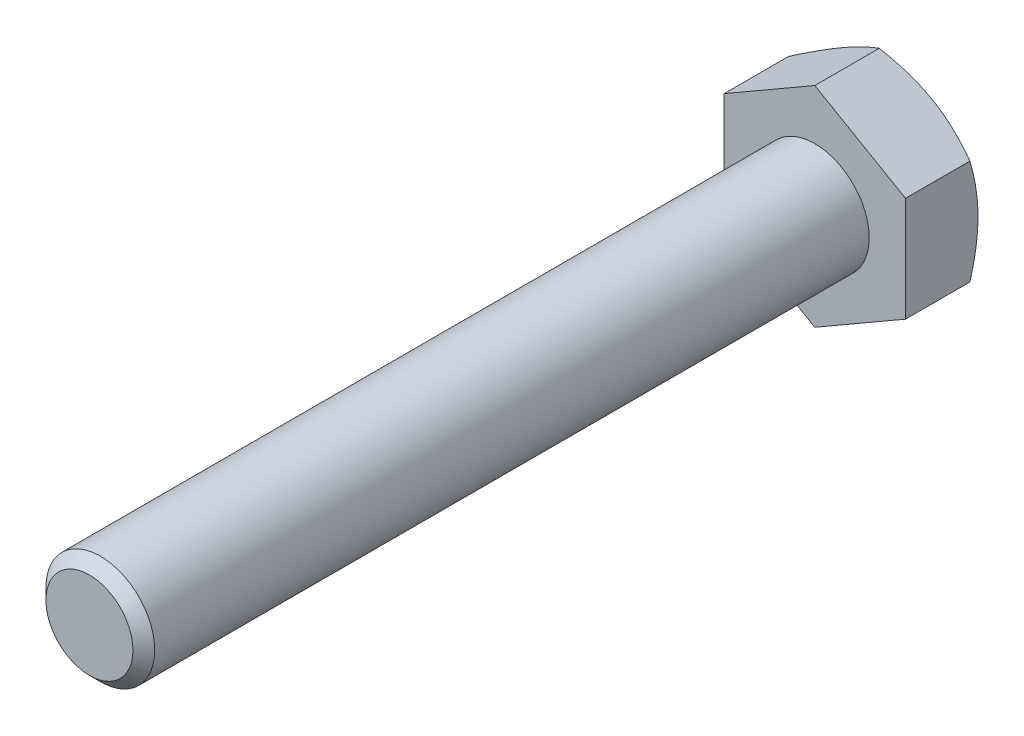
ISO-10303-21;
HEADER;
FILE_DESCRIPTION(('STEP AP214'),'2;1');
FILE_NAME('part.step','',(''),(''),'','','');
FILE_SCHEMA(('AUTOMOTIVE_DESIGN { 1 0 10303 214 1 1 1 1 }'));
ENDSEC;
DATA;
#1=APPLICATION_CONTEXT('core data for automotive mechanical design processes');
#2=APPLICATION_PROTOCOL_DEFINITION('international standard','automotive_design',2000,#1);
#3=PRODUCT_CONTEXT('',#1,'mechanical');
#4=PRODUCT('Part','Part','',(#3));
#5=PRODUCT_RELATED_PRODUCT_CATEGORY('part','',(#4));
#6=PRODUCT_DEFINITION_FORMATION('','',#4);
#7=PRODUCT_DEFINITION_CONTEXT('part definition',#1,'design');
#8=PRODUCT_DEFINITION('design','',#6,#7);
#9=PRODUCT_DEFINITION_SHAPE('','',#8);
#10=(LENGTH_UNIT() NAMED_UNIT(*) SI_UNIT(.MILLI.,.METRE.));
#11=(NAMED_UNIT(*) PLANE_ANGLE_UNIT() SI_UNIT($,.RADIAN.));
#12=(NAMED_UNIT(*) SI_UNIT($,.STERADIAN.) SOLID_ANGLE_UNIT());
#13=UNCERTAINTY_MEASURE_WITH_UNIT(LENGTH_MEASURE(1.E-05),#10,'distance_accuracy_value','');
#14=(GEOMETRIC_REPRESENTATION_CONTEXT(3) GLOBAL_UNCERTAINTY_ASSIGNED_CONTEXT((#13)) GLOBAL_UNIT_ASSIGNED_CONTEXT((#10,
#11,#12)) REPRESENTATION_CONTEXT('',''));
#15=CARTESIAN_POINT('',(0.,0.,0.));
#16=DIRECTION('',(0.,0.,1.));
#17=DIRECTION('',(1.,0.,0.));
#18=AXIS2_PLACEMENT_3D('',#15,#16,#17);
#19=CARTESIAN_POINT('',(0.,0.,40.));
#20=DIRECTION('',(0.,0.,1.));
#21=DIRECTION('',(1.,0.,0.));
#22=AXIS2_PLACEMENT_3D('',#19,#20,#21);
#23=PLANE('',#22);
#24=CARTESIAN_POINT('',(0.,0.,40.));
#25=DIRECTION('',(0.,0.,1.));
#26=DIRECTION('',(1.,0.,0.));
#27=AXIS2_PLACEMENT_3D('',#24,#25,#26);
#28=CIRCLE('',#27,2.4);
#29=CARTESIAN_POINT('',(2.40000000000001,0.,40.));
#30=VERTEX_POINT('',#29);
#31=EDGE_CURVE('E202',#30,#30,#28,.T.);
#32=ORIENTED_EDGE('',*,*,#31,.T.);
#33=EDGE_LOOP('',(#32));
#34=FACE_BOUND('',#33,.T.);
#35=ADVANCED_FACE('F28',(#34),#23,.T.);
#36=CARTESIAN_POINT('',(0.,0.,0.));
#37=DIRECTION('',(0.,0.,1.));
#38=DIRECTION('',(1.,0.,0.));
#39=AXIS2_PLACEMENT_3D('',#36,#37,#38);
#40=CYLINDRICAL_SURFACE('',#39,3.);
#41=CARTESIAN_POINT('',(0.,0.,39.4));
#42=DIRECTION('',(0.,0.,1.));
#43=DIRECTION('',(1.,0.,0.));
#44=AXIS2_PLACEMENT_3D('',#41,#42,#43);
#45=CIRCLE('',#44,3.);
#46=CARTESIAN_POINT('',(3.,0.,39.4));
#47=VERTEX_POINT('',#46);
#48=EDGE_CURVE('E204',#47,#47,#45,.F.);
#49=ORIENTED_EDGE('',*,*,#48,.T.);
#50=EDGE_LOOP('',(#49));
#51=FACE_BOUND('',#50,.T.);
#52=CARTESIAN_POINT('',(0.,0.,0.));
#53=DIRECTION('',(0.,0.,1.));
#54=DIRECTION('',(1.,0.,0.));
#55=AXIS2_PLACEMENT_3D('',#52,#53,#54);
#56=CIRCLE('',#55,3.);
#57=CARTESIAN_POINT('',(3.,0.,0.));
#58=VERTEX_POINT('',#57);
#59=EDGE_CURVE('E205',#58,#58,#56,.F.);
#60=ORIENTED_EDGE('',*,*,#59,.F.);
#61=EDGE_LOOP('',(#60));
#62=FACE_BOUND('',#61,.T.);
#63=ADVANCED_FACE('F193',(#51,#62),#40,.T.);
#64=CARTESIAN_POINT('',(0.,0.,40.));
#65=DIRECTION('',(0.,0.,-1.));
#66=DIRECTION('',(-1.,0.,0.));
#67=AXIS2_PLACEMENT_3D('',#64,#65,#66);
#68=CONICAL_SURFACE('',#67,2.4,0.785398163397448);
#69=ORIENTED_EDGE('',*,*,#48,.F.);
#70=EDGE_LOOP('',(#69));
#71=FACE_BOUND('',#70,.T.);
#72=ORIENTED_EDGE('',*,*,#31,.F.);
#73=EDGE_LOOP('',(#72));
#74=FACE_BOUND('',#73,.T.);
#75=ADVANCED_FACE('F198',(#71,#74),#68,.T.);
#76=CARTESIAN_POINT('',(0.,5.77350269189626,-4.));
#77=DIRECTION('',(0.499999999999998,0.86602540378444,0.));
#78=DIRECTION('',(-0.86602540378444,0.499999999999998,0.));
#79=AXIS2_PLACEMENT_3D('',#76,#77,#78);
#80=PLANE('',#79);
#81=CARTESIAN_POINT('',(-0.000200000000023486,5.7736181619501,-3.55335134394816));
#82=CARTESIAN_POINT('',(0.219534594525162,5.64675433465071,-3.62661343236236));
#83=CARTESIAN_POINT('',(0.441148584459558,5.5188054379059,-3.6932486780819));
#84=CARTESIAN_POINT('',(0.888213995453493,5.26069210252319,-3.80956100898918));
#85=CARTESIAN_POINT('',(1.11367335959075,5.13052307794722,-3.85919695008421));
#86=CARTESIAN_POINT('',(1.56183230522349,4.87177839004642,-3.9364489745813));
#87=CARTESIAN_POINT('',(1.78446209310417,4.74324302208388,-3.96457962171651));
#88=CARTESIAN_POINT('',(2.11918990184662,4.54998783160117,-3.98980507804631));
#89=CARTESIAN_POINT('',(2.23084219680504,4.48552534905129,-3.99538654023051));
#90=CARTESIAN_POINT('',(2.45424997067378,4.35654081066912,-4.00079778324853));
#91=CARTESIAN_POINT('',(2.5660054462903,4.29201875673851,-4.00062774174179));
#92=CARTESIAN_POINT('',(2.87218423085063,4.11524635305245,-3.99224636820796));
#93=CARTESIAN_POINT('',(3.0665060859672,4.00305457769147,-3.97817022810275));
#94=CARTESIAN_POINT('',(3.45386010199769,3.77941563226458,-3.93353474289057));
#95=CARTESIAN_POINT('',(3.64689090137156,3.66796924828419,-3.90296013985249));
#96=CARTESIAN_POINT('',(4.03502534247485,3.44387972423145,-3.82653150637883));
#97=CARTESIAN_POINT('',(4.23007999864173,3.33126486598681,-3.78035362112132));
#98=CARTESIAN_POINT('',(4.61728034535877,3.10771464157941,-3.67554820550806));
#99=CARTESIAN_POINT('',(4.80943099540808,2.99677641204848,-3.61694529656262));
#100=CARTESIAN_POINT('',(5.0002,2.8866358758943,-3.55335134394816));
#101=B_SPLINE_CURVE_WITH_KNOTS('',3,(#81,#82,#83,#84,#85,#86,#87,#88,#89,#90,#91,#92,#93,#94,
#95,#96,#97,#98,#99,#100),.UNSPECIFIED.,.F.,.F.,(4,2,2,2,2,2,2,2,2,4),(0.,0.792555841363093,
1.58701660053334,2.36181537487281,2.74884076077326,3.13585419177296,3.8096236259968,
4.4840172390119,5.1733688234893,5.86136694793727),.UNSPECIFIED.);
#102=CARTESIAN_POINT('',(0.,5.77350269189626,-3.55341801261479));
#103=VERTEX_POINT('',#102);
#104=CARTESIAN_POINT('',(2.49999999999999,4.3301270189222,-4.));
#105=VERTEX_POINT('',#104);
#106=EDGE_CURVE('E238',#103,#105,#101,.T.);
#107=ORIENTED_EDGE('',*,*,#106,.F.);
#108=DIRECTION('',(0.,0.,1.));
#109=VECTOR('',#108,1.);
#110=CARTESIAN_POINT('',(0.,5.77350269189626,-4.));
#111=LINE('',#110,#109);
#112=CARTESIAN_POINT('',(0.,5.77350269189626,0.));
#113=VERTEX_POINT('',#112);
#114=EDGE_CURVE('E212',#103,#113,#111,.T.);
#115=ORIENTED_EDGE('',*,*,#114,.T.);
#116=DIRECTION('',(-0.86602540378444,0.499999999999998,0.));
#117=VECTOR('',#116,1.);
#118=CARTESIAN_POINT('',(0.,5.77350269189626,0.));
#119=LINE('',#118,#117);
#120=CARTESIAN_POINT('',(5.,2.88675134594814,0.));
#121=VERTEX_POINT('',#120);
#122=EDGE_CURVE('E236',#121,#113,#119,.T.);
#123=ORIENTED_EDGE('',*,*,#122,.F.);
#124=DIRECTION('',(0.,0.,1.));
#125=VECTOR('',#124,1.);
#126=CARTESIAN_POINT('',(5.,2.88675134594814,-4.));
#127=LINE('',#126,#125);
#128=CARTESIAN_POINT('',(5.,2.88675134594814,-3.55341801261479));
#129=VERTEX_POINT('',#128);
#130=EDGE_CURVE('E209',#129,#121,#127,.T.);
#131=ORIENTED_EDGE('',*,*,#130,.F.);
#132=EDGE_CURVE('E168',#105,#129,#101,.T.);
#133=ORIENTED_EDGE('',*,*,#132,.F.);
#134=EDGE_LOOP('',(#107,#115,#123,#131,#133));
#135=FACE_BOUND('',#134,.T.);
#136=ADVANCED_FACE('F178',(#135),#80,.T.);
#137=CARTESIAN_POINT('',(5.,-2.88675134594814,-4.));
#138=DIRECTION('',(1.,0.,0.));
#139=DIRECTION('',(0.,0.,-1.));
#140=AXIS2_PLACEMENT_3D('',#137,#138,#139);
#141=PLANE('',#140);
#142=CARTESIAN_POINT('',(5.,-7.87365701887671,-1.5017575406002));
#143=CARTESIAN_POINT('',(5.,-7.65421637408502,-1.60868091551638));
#144=CARTESIAN_POINT('',(5.,-7.43428458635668,-1.71461296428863));
#145=CARTESIAN_POINT('',(5.,-6.99317792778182,-1.92393906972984));
#146=CARTESIAN_POINT('',(5.,-6.77200287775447,-2.02733274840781));
#147=CARTESIAN_POINT('',(5.,-6.32706593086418,-2.23152152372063));
#148=CARTESIAN_POINT('',(5.,-6.10329657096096,-2.3323004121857));
#149=CARTESIAN_POINT('',(5.,-5.65401907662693,-2.52988978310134));
#150=CARTESIAN_POINT('',(5.,-5.42851102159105,-2.62670044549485));
#151=CARTESIAN_POINT('',(5.,-4.96773019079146,-2.81850105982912));
#152=CARTESIAN_POINT('',(5.,-4.73238523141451,-2.91331851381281));
#153=CARTESIAN_POINT('',(5.,-4.2589865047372,-3.09606229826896));
#154=CARTESIAN_POINT('',(5.,-4.02093244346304,-3.18398787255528));
#155=CARTESIAN_POINT('',(5.,-3.54214478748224,-3.35072723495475));
#156=CARTESIAN_POINT('',(5.,-3.301417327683,-3.42955846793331));
#157=CARTESIAN_POINT('',(5.,-2.81651125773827,-3.57565910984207));
#158=CARTESIAN_POINT('',(5.,-2.57233372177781,-3.64293203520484));
#159=CARTESIAN_POINT('',(5.,-2.08173956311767,-3.7624103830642));
#160=CARTESIAN_POINT('',(5.,-1.83534384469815,-3.81470009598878));
#161=CARTESIAN_POINT('',(5.,-1.33936717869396,-3.90133365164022));
#162=CARTESIAN_POINT('',(5.,-1.08978658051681,-3.93567944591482));
#163=CARTESIAN_POINT('',(5.,-0.591994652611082,-3.98324171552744));
#164=CARTESIAN_POINT('',(5.,-0.34381084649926,-3.99673913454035));
#165=CARTESIAN_POINT('',(5.,0.152820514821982,-4.00220795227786));
#166=CARTESIAN_POINT('',(5.,0.401268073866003,-3.99417903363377));
#167=CARTESIAN_POINT('',(5.,0.819539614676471,-3.96311999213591));
#168=CARTESIAN_POINT('',(5.,0.989794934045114,-3.94552930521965));
#169=CARTESIAN_POINT('',(5.,1.32912938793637,-3.90127081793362));
#170=CARTESIAN_POINT('',(5.,1.49820837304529,-3.87460188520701));
#171=CARTESIAN_POINT('',(5.,2.00341173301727,-3.78237229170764));
#172=CARTESIAN_POINT('',(5.,2.33733597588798,-3.7046029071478));
#173=CARTESIAN_POINT('',(5.,2.83691487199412,-3.56883106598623));
#174=CARTESIAN_POINT('',(5.,3.00513229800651,-3.51971360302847));
#175=CARTESIAN_POINT('',(5.,3.33993504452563,-3.41615110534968));
#176=CARTESIAN_POINT('',(5.,3.50652035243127,-3.36170602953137));
#177=CARTESIAN_POINT('',(5.,3.83810926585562,-3.24838071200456));
#178=CARTESIAN_POINT('',(5.,4.00311330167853,-3.18950171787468));
#179=CARTESIAN_POINT('',(5.,4.33173746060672,-3.06802383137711));
#180=CARTESIAN_POINT('',(5.,4.49535761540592,-3.00542502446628));
#181=CARTESIAN_POINT('',(5.,4.9359829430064,-2.83201950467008));
#182=CARTESIAN_POINT('',(5.,5.21182602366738,-2.71826266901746));
#183=CARTESIAN_POINT('',(5.,5.76066658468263,-2.48405585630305));
#184=CARTESIAN_POINT('',(5.,6.03366374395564,-2.36360513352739));
#185=CARTESIAN_POINT('',(5.,6.57746623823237,-2.11759609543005));
#186=CARTESIAN_POINT('',(5.,6.84827068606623,-1.99203582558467));
#187=CARTESIAN_POINT('',(5.,7.38802449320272,-1.73703058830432));
#188=CARTESIAN_POINT('',(5.,7.65697392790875,-1.60758577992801));
#189=CARTESIAN_POINT('',(5.,8.19381940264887,-1.34544789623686));
#190=CARTESIAN_POINT('',(5.,8.46171304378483,-1.21274991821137));
#191=CARTESIAN_POINT('',(5.,8.99628800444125,-0.944933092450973));
#192=CARTESIAN_POINT('',(5.,9.26296931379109,-0.809814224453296));
#193=CARTESIAN_POINT('',(5.,10.0614145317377,-0.401627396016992));
#194=CARTESIAN_POINT('',(5.,10.5917004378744,-0.125669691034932));
#195=CARTESIAN_POINT('',(5.,11.5934978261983,0.401869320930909));
#196=CARTESIAN_POINT('',(5.,12.0652823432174,0.652934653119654));
#197=CARTESIAN_POINT('',(5.,13.0072652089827,1.1580917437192));
#198=CARTESIAN_POINT('',(5.,13.4774634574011,1.41218368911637));
#199=CARTESIAN_POINT('',(5.,14.4150598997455,1.92174727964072));
#200=CARTESIAN_POINT('',(5.,14.8824621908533,2.17721139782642));
#201=CARTESIAN_POINT('',(5.,15.8162766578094,2.68985606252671));
#202=CARTESIAN_POINT('',(5.,16.2826889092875,2.94703647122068));
#203=CARTESIAN_POINT('',(5.,16.7487534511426,3.20484156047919));
#204=B_SPLINE_CURVE_WITH_KNOTS('',3,(#142,#143,#144,#145,#146,#147,#148,#149,#150,#151,#152,
#153,#154,#155,#156,#157,#158,#159,#160,#161,#162,#163,#164,#165,#166,#167,#168,#169,#170,#171,
#172,#173,#174,#175,#176,#177,#178,#179,#180,#181,#182,#183,#184,#185,#186,#187,#188,#189,#190,
#191,#192,#193,#194,#195,#196,#197,#198,#199,#200,#201,#202,#203),.UNSPECIFIED.,.F.,.F.,(4,2,2,
2,2,2,2,2,2,2,2,2,2,2,2,2,2,2,2,2,2,2,2,2,2,2,2,2,2,2,4),(0.,0.732320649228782,1.46474969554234,
2.20096737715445,2.93715163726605,3.69825037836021,4.45943251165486,5.2191293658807,
5.97859468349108,6.73369963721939,7.48872245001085,8.2334792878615,8.97824710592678,
9.49148539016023,10.0047877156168,11.0318914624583,11.5575684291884,12.0832494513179,
12.6087831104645,13.1343047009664,14.0293094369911,14.9244140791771,15.819864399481,
16.7152781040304,17.612136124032,18.5090016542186,20.3023290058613,21.9056050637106,
23.5089806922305,25.106957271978,26.7048070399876),.UNSPECIFIED.);
#205=CARTESIAN_POINT('',(5.,0.,-4.));
#206=VERTEX_POINT('',#205);
#207=EDGE_CURVE('E166',#129,#206,#204,.F.);
#208=ORIENTED_EDGE('',*,*,#207,.F.);
#209=ORIENTED_EDGE('',*,*,#130,.T.);
#210=DIRECTION('',(0.,1.,0.));
#211=VECTOR('',#210,1.);
#212=CARTESIAN_POINT('',(5.,-2.88675134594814,0.));
#213=LINE('',#212,#211);
#214=CARTESIAN_POINT('',(5.,-2.88675134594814,0.));
#215=VERTEX_POINT('',#214);
#216=EDGE_CURVE('E214',#215,#121,#213,.T.);
#217=ORIENTED_EDGE('',*,*,#216,.F.);
#218=DIRECTION('',(0.,0.,1.));
#219=VECTOR('',#218,1.);
#220=CARTESIAN_POINT('',(5.,-2.88675134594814,-4.));
#221=LINE('',#220,#219);
#222=CARTESIAN_POINT('',(5.,-2.88675134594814,-3.55341801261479));
#223=VERTEX_POINT('',#222);
#224=EDGE_CURVE('E220',#223,#215,#221,.T.);
#225=ORIENTED_EDGE('',*,*,#224,.F.);
#226=EDGE_CURVE('E161',#206,#223,#204,.F.);
#227=ORIENTED_EDGE('',*,*,#226,.F.);
#228=EDGE_LOOP('',(#208,#209,#217,#225,#227));
#229=FACE_BOUND('',#228,.T.);
#230=ADVANCED_FACE('F174',(#229),#141,.T.);
#231=CARTESIAN_POINT('',(0.,-5.77350269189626,-4.));
#232=DIRECTION('',(0.499999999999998,-0.86602540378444,0.));
#233=DIRECTION('',(0.86602540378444,0.499999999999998,0.));
#234=AXIS2_PLACEMENT_3D('',#231,#232,#233);
#235=PLANE('',#234);
#236=CARTESIAN_POINT('',(5.0002,-2.8866358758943,-3.55335134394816));
#237=CARTESIAN_POINT('',(4.78046540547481,-3.01349970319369,-3.62661343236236));
#238=CARTESIAN_POINT('',(4.55885141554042,-3.1414485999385,-3.6932486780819));
#239=CARTESIAN_POINT('',(4.11178600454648,-3.39956193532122,-3.80956100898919));
#240=CARTESIAN_POINT('',(3.88632664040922,-3.52973095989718,-3.85919695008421));
#241=CARTESIAN_POINT('',(3.43816769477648,-3.78847564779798,-3.9364489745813));
#242=CARTESIAN_POINT('',(3.2155379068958,-3.91701101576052,-3.96457962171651));
#243=CARTESIAN_POINT('',(2.88081009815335,-4.11026620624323,-3.98980507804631));
#244=CARTESIAN_POINT('',(2.76915780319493,-4.17472868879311,-3.99538654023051));
#245=CARTESIAN_POINT('',(2.54575002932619,-4.30371322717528,-4.00079778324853));
#246=CARTESIAN_POINT('',(2.43399455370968,-4.36823528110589,-4.00062774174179));
#247=CARTESIAN_POINT('',(2.12781576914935,-4.54500768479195,-3.99224636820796));
#248=CARTESIAN_POINT('',(1.93349391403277,-4.65719946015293,-3.97817022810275));
#249=CARTESIAN_POINT('',(1.54613989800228,-4.88083840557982,-3.93353474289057));
#250=CARTESIAN_POINT('',(1.35310909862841,-4.99228478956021,-3.90296013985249));
#251=CARTESIAN_POINT('',(0.964974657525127,-5.21637431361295,-3.82653150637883));
#252=CARTESIAN_POINT('',(0.769920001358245,-5.32898917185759,-3.78035362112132));
#253=CARTESIAN_POINT('',(0.38271965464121,-5.55253939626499,-3.67554820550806));
#254=CARTESIAN_POINT('',(0.190569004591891,-5.66347762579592,-3.61694529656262));
#255=CARTESIAN_POINT('',(-0.000200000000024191,-5.7736181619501,-3.55335134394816));
#256=B_SPLINE_CURVE_WITH_KNOTS('',3,(#236,#237,#238,#239,#240,#241,#242,#243,#244,#245,#246,
#247,#248,#249,#250,#251,#252,#253,#254,#255),.UNSPECIFIED.,.F.,.F.,(4,2,2,2,2,2,2,2,2,4),(0.,
0.792555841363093,1.58701660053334,2.36181537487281,2.74884076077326,3.13585419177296,
3.8096236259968,4.48401723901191,5.1733688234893,5.86136694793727),.UNSPECIFIED.);
#257=CARTESIAN_POINT('',(2.49999999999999,-4.3301270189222,-4.));
#258=VERTEX_POINT('',#257);
#259=EDGE_CURVE('E167',#223,#258,#256,.T.);
#260=ORIENTED_EDGE('',*,*,#259,.F.);
#261=ORIENTED_EDGE('',*,*,#224,.T.);
#262=DIRECTION('',(0.86602540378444,0.499999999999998,0.));
#263=VECTOR('',#262,1.);
#264=CARTESIAN_POINT('',(0.,-5.77350269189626,0.));
#265=LINE('',#264,#263);
#266=CARTESIAN_POINT('',(0.,-5.77350269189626,0.));
#267=VERTEX_POINT('',#266);
#268=EDGE_CURVE('E225',#267,#215,#265,.T.);
#269=ORIENTED_EDGE('',*,*,#268,.F.);
#270=DIRECTION('',(0.,0.,1.));
#271=VECTOR('',#270,1.);
#272=CARTESIAN_POINT('',(0.,-5.77350269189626,-4.));
#273=LINE('',#272,#271);
#274=CARTESIAN_POINT('',(0.,-5.77350269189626,-3.55341801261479));
#275=VERTEX_POINT('',#274);
#276=EDGE_CURVE('E218',#275,#267,#273,.T.);
#277=ORIENTED_EDGE('',*,*,#276,.F.);
#278=EDGE_CURVE('E155',#258,#275,#256,.T.);
#279=ORIENTED_EDGE('',*,*,#278,.F.);
#280=EDGE_LOOP('',(#260,#261,#269,#277,#279));
#281=FACE_BOUND('',#280,.T.);
#282=ADVANCED_FACE('F177',(#281),#235,.T.);
#283=CARTESIAN_POINT('',(0.,-5.77350269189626,-4.));
#284=DIRECTION('',(-0.500000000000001,-0.866025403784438,0.));
#285=DIRECTION('',(0.866025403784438,-0.500000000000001,0.));
#286=AXIS2_PLACEMENT_3D('',#283,#284,#285);
#287=PLANE('',#286);
#288=CARTESIAN_POINT('',(0.000199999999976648,-5.7736181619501,-3.55335134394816));
#289=CARTESIAN_POINT('',(-0.219534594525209,-5.64675433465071,-3.62661343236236));
#290=CARTESIAN_POINT('',(-0.441148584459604,-5.5188054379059,-3.6932486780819));
#291=CARTESIAN_POINT('',(-0.888213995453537,-5.26069210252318,-3.80956100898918));
#292=CARTESIAN_POINT('',(-1.1136733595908,-5.13052307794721,-3.8591969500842));
#293=CARTESIAN_POINT('',(-1.56183230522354,-4.87177839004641,-3.9364489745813));
#294=CARTESIAN_POINT('',(-1.78446209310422,-4.74324302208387,-3.9645796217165));
#295=CARTESIAN_POINT('',(-2.11918990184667,-4.54998783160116,-3.98980507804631));
#296=CARTESIAN_POINT('',(-2.23084219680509,-4.48552534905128,-3.99538654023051));
#297=CARTESIAN_POINT('',(-2.45424997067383,-4.35654081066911,-4.00079778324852));
#298=CARTESIAN_POINT('',(-2.56600544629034,-4.2920187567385,-4.00062774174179));
#299=CARTESIAN_POINT('',(-2.87218423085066,-4.11524635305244,-3.99224636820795));
#300=CARTESIAN_POINT('',(-3.06650608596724,-4.00305457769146,-3.97817022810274));
#301=CARTESIAN_POINT('',(-3.45386010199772,-3.77941563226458,-3.93353474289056));
#302=CARTESIAN_POINT('',(-3.64689090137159,-3.66796924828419,-3.90296013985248));
#303=CARTESIAN_POINT('',(-4.03502534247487,-3.44387972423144,-3.82653150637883));
#304=CARTESIAN_POINT('',(-4.23007999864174,-3.33126486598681,-3.78035362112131));
#305=CARTESIAN_POINT('',(-4.61728034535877,-3.10771464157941,-3.67554820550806));
#306=CARTESIAN_POINT('',(-4.80943099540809,-2.99677641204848,-3.61694529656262));
#307=CARTESIAN_POINT('',(-5.0002,-2.8866358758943,-3.55335134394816));
#308=B_SPLINE_CURVE_WITH_KNOTS('',3,(#288,#289,#290,#291,#292,#293,#294,#295,#296,#297,#298,
#299,#300,#301,#302,#303,#304,#305,#306,#307),.UNSPECIFIED.,.F.,.F.,(4,2,2,2,2,2,2,2,2,4),(0.,
0.792555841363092,1.58701660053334,2.36181537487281,2.74884076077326,3.13585419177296,
3.80962362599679,4.48401723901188,5.17336882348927,5.86136694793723),.UNSPECIFIED.);
#309=CARTESIAN_POINT('',(-2.50000000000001,-4.33012701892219,-4.));
#310=VERTEX_POINT('',#309);
#311=EDGE_CURVE('E257',#275,#310,#308,.T.);
#312=ORIENTED_EDGE('',*,*,#311,.F.);
#313=ORIENTED_EDGE('',*,*,#276,.T.);
#314=DIRECTION('',(0.866025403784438,-0.500000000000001,0.));
#315=VECTOR('',#314,1.);
#316=CARTESIAN_POINT('',(0.,-5.77350269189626,0.));
#317=LINE('',#316,#315);
#318=CARTESIAN_POINT('',(-5.,-2.88675134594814,0.));
#319=VERTEX_POINT('',#318);
#320=EDGE_CURVE('E228',#319,#267,#317,.T.);
#321=ORIENTED_EDGE('',*,*,#320,.F.);
#322=DIRECTION('',(0.,0.,1.));
#323=VECTOR('',#322,1.);
#324=CARTESIAN_POINT('',(-5.,-2.88675134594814,-4.));
#325=LINE('',#324,#323);
#326=CARTESIAN_POINT('',(-5.,-2.88675134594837,-3.55341801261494));
#327=VERTEX_POINT('',#326);
#328=EDGE_CURVE('E216',#327,#319,#325,.T.);
#329=ORIENTED_EDGE('',*,*,#328,.F.);
#330=EDGE_CURVE('E104',#310,#327,#308,.T.);
#331=ORIENTED_EDGE('',*,*,#330,.F.);
#332=EDGE_LOOP('',(#312,#313,#321,#329,#331));
#333=FACE_BOUND('',#332,.T.);
#334=ADVANCED_FACE('F182',(#333),#287,.T.);
#335=CARTESIAN_POINT('',(-5.,-2.88675134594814,-4.));
#336=DIRECTION('',(-1.,0.,0.));
#337=DIRECTION('',(0.,0.,1.));
#338=AXIS2_PLACEMENT_3D('',#335,#336,#337);
#339=PLANE('',#338);
#340=CARTESIAN_POINT('',(-5.,-7.8736570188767,-1.5017575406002));
#341=CARTESIAN_POINT('',(-5.,-7.65421637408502,-1.60868091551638));
#342=CARTESIAN_POINT('',(-5.,-7.43428458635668,-1.71461296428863));
#343=CARTESIAN_POINT('',(-5.,-6.99317792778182,-1.92393906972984));
#344=CARTESIAN_POINT('',(-5.,-6.77200287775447,-2.02733274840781));
#345=CARTESIAN_POINT('',(-5.,-6.32706593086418,-2.23152152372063));
#346=CARTESIAN_POINT('',(-5.,-6.10329657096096,-2.3323004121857));
#347=CARTESIAN_POINT('',(-5.,-5.65401907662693,-2.52988978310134));
#348=CARTESIAN_POINT('',(-5.,-5.42851102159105,-2.62670044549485));
#349=CARTESIAN_POINT('',(-5.,-4.96773019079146,-2.81850105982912));
#350=CARTESIAN_POINT('',(-5.,-4.73238523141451,-2.91331851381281));
#351=CARTESIAN_POINT('',(-5.,-4.2589865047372,-3.09606229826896));
#352=CARTESIAN_POINT('',(-5.,-4.02093244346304,-3.18398787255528));
#353=CARTESIAN_POINT('',(-5.,-3.54214478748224,-3.35072723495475));
#354=CARTESIAN_POINT('',(-5.,-3.301417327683,-3.42955846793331));
#355=CARTESIAN_POINT('',(-5.,-2.81651125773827,-3.57565910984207));
#356=CARTESIAN_POINT('',(-5.,-2.57233372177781,-3.64293203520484));
#357=CARTESIAN_POINT('',(-5.,-2.08173956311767,-3.7624103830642));
#358=CARTESIAN_POINT('',(-5.,-1.83534384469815,-3.81470009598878));
#359=CARTESIAN_POINT('',(-5.,-1.33936717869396,-3.90133365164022));
#360=CARTESIAN_POINT('',(-5.,-1.08978658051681,-3.93567944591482));
#361=CARTESIAN_POINT('',(-5.,-0.591994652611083,-3.98324171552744));
#362=CARTESIAN_POINT('',(-5.,-0.343810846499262,-3.99673913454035));
#363=CARTESIAN_POINT('',(-5.,0.152820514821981,-4.00220795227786));
#364=CARTESIAN_POINT('',(-5.,0.401268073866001,-3.99417903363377));
#365=CARTESIAN_POINT('',(-5.,0.81953961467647,-3.96311999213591));
#366=CARTESIAN_POINT('',(-5.,0.989794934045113,-3.94552930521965));
#367=CARTESIAN_POINT('',(-5.,1.32912938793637,-3.90127081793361));
#368=CARTESIAN_POINT('',(-5.,1.49820837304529,-3.87460188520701));
#369=CARTESIAN_POINT('',(-5.,2.00341173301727,-3.78237229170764));
#370=CARTESIAN_POINT('',(-5.,2.33733597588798,-3.7046029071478));
#371=CARTESIAN_POINT('',(-5.,2.83691487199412,-3.56883106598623));
#372=CARTESIAN_POINT('',(-5.,3.00513229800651,-3.51971360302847));
#373=CARTESIAN_POINT('',(-5.,3.33993504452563,-3.41615110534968));
#374=CARTESIAN_POINT('',(-5.,3.50652035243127,-3.36170602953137));
#375=CARTESIAN_POINT('',(-5.,3.83810926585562,-3.24838071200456));
#376=CARTESIAN_POINT('',(-5.,4.00311330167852,-3.18950171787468));
#377=CARTESIAN_POINT('',(-5.,4.33173746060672,-3.06802383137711));
#378=CARTESIAN_POINT('',(-5.,4.49535761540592,-3.00542502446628));
#379=CARTESIAN_POINT('',(-5.,4.9359829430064,-2.83201950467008));
#380=CARTESIAN_POINT('',(-5.,5.21182602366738,-2.71826266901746));
#381=CARTESIAN_POINT('',(-5.,5.76066658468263,-2.48405585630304));
#382=CARTESIAN_POINT('',(-5.,6.03366374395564,-2.36360513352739));
#383=CARTESIAN_POINT('',(-5.,6.57746623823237,-2.11759609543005));
#384=CARTESIAN_POINT('',(-5.,6.84827068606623,-1.99203582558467));
#385=CARTESIAN_POINT('',(-5.,7.38802449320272,-1.73703058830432));
#386=CARTESIAN_POINT('',(-5.,7.65697392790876,-1.60758577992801));
#387=CARTESIAN_POINT('',(-5.,8.19381940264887,-1.34544789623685));
#388=CARTESIAN_POINT('',(-5.,8.46171304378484,-1.21274991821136));
#389=CARTESIAN_POINT('',(-5.,8.99628800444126,-0.944933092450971));
#390=CARTESIAN_POINT('',(-5.,9.26296931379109,-0.809814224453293));
#391=CARTESIAN_POINT('',(-5.,10.0614145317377,-0.401627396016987));
#392=CARTESIAN_POINT('',(-5.,10.5917004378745,-0.125669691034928));
#393=CARTESIAN_POINT('',(-5.,11.5934978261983,0.401869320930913));
#394=CARTESIAN_POINT('',(-5.,12.0652823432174,0.652934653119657));
#395=CARTESIAN_POINT('',(-5.,13.0072652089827,1.15809174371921));
#396=CARTESIAN_POINT('',(-5.,13.4774634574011,1.41218368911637));
#397=CARTESIAN_POINT('',(-5.,14.4150598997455,1.92174727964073));
#398=CARTESIAN_POINT('',(-5.,14.8824621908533,2.17721139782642));
#399=CARTESIAN_POINT('',(-5.,15.8162766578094,2.68985606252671));
#400=CARTESIAN_POINT('',(-5.,16.2826889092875,2.94703647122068));
#401=CARTESIAN_POINT('',(-5.,16.7487534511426,3.20484156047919));
#402=B_SPLINE_CURVE_WITH_KNOTS('',3,(#340,#341,#342,#343,#344,#345,#346,#347,#348,#349,#350,
#351,#352,#353,#354,#355,#356,#357,#358,#359,#360,#361,#362,#363,#364,#365,#366,#367,#368,#369,
#370,#371,#372,#373,#374,#375,#376,#377,#378,#379,#380,#381,#382,#383,#384,#385,#386,#387,#388,
#389,#390,#391,#392,#393,#394,#395,#396,#397,#398,#399,#400,#401),.UNSPECIFIED.,.F.,.F.,(4,2,2,
2,2,2,2,2,2,2,2,2,2,2,2,2,2,2,2,2,2,2,2,2,2,2,2,2,2,2,4),(0.,0.732320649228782,1.46474969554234,
2.20096737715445,2.93715163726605,3.69825037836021,4.45943251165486,5.2191293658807,
5.97859468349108,6.73369963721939,7.48872245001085,8.2334792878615,8.97824710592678,
9.49148539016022,10.0047877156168,11.0318914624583,11.5575684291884,12.0832494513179,
12.6087831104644,13.1343047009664,14.0293094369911,14.9244140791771,15.819864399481,
16.7152781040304,17.612136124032,18.5090016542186,20.3023290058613,21.9056050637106,
23.5089806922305,25.106957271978,26.7048070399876),.UNSPECIFIED.);
#403=CARTESIAN_POINT('',(-5.,0.,-4.));
#404=VERTEX_POINT('',#403);
#405=EDGE_CURVE('E99',#327,#404,#402,.T.);
#406=ORIENTED_EDGE('',*,*,#405,.F.);
#407=ORIENTED_EDGE('',*,*,#328,.T.);
#408=DIRECTION('',(0.,-1.,0.));
#409=VECTOR('',#408,1.);
#410=CARTESIAN_POINT('',(-5.,-2.88675134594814,0.));
#411=LINE('',#410,#409);
#412=CARTESIAN_POINT('',(-5.,2.88675134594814,0.));
#413=VERTEX_POINT('',#412);
#414=EDGE_CURVE('E231',#413,#319,#411,.T.);
#415=ORIENTED_EDGE('',*,*,#414,.F.);
#416=DIRECTION('',(0.,0.,1.));
#417=VECTOR('',#416,1.);
#418=CARTESIAN_POINT('',(-5.,2.88675134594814,-4.));
#419=LINE('',#418,#417);
#420=CARTESIAN_POINT('',(-5.,2.88675134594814,-3.55341801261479));
#421=VERTEX_POINT('',#420);
#422=EDGE_CURVE('E125',#421,#413,#419,.T.);
#423=ORIENTED_EDGE('',*,*,#422,.F.);
#424=EDGE_CURVE('E108',#404,#421,#402,.T.);
#425=ORIENTED_EDGE('',*,*,#424,.F.);
#426=EDGE_LOOP('',(#406,#407,#415,#423,#425));
#427=FACE_BOUND('',#426,.T.);
#428=ADVANCED_FACE('F123',(#427),#339,.T.);
#429=CARTESIAN_POINT('',(-5.,2.88675134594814,-4.));
#430=DIRECTION('',(-0.500000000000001,0.866025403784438,0.));
#431=DIRECTION('',(-0.866025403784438,-0.500000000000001,0.));
#432=AXIS2_PLACEMENT_3D('',#429,#430,#431);
#433=PLANE('',#432);
#434=CARTESIAN_POINT('',(-5.0002,2.8866358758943,-3.55335134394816));
#435=CARTESIAN_POINT('',(-4.78046540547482,3.01349970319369,-3.62661343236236));
#436=CARTESIAN_POINT('',(-4.55885141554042,3.1414485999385,-3.6932486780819));
#437=CARTESIAN_POINT('',(-4.11178600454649,3.39956193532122,-3.80956100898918));
#438=CARTESIAN_POINT('',(-3.88632664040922,3.52973095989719,-3.8591969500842));
#439=CARTESIAN_POINT('',(-3.43816769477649,3.78847564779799,-3.9364489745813));
#440=CARTESIAN_POINT('',(-3.2155379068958,3.91701101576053,-3.9645796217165));
#441=CARTESIAN_POINT('',(-2.88081009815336,4.11026620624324,-3.98980507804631));
#442=CARTESIAN_POINT('',(-2.76915780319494,4.17472868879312,-3.99538654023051));
#443=CARTESIAN_POINT('',(-2.5457500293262,4.30371322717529,-4.00079778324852));
#444=CARTESIAN_POINT('',(-2.43399455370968,4.3682352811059,-4.00062774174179));
#445=CARTESIAN_POINT('',(-2.12781576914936,4.54500768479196,-3.99224636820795));
#446=CARTESIAN_POINT('',(-1.93349391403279,4.65719946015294,-3.97817022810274));
#447=CARTESIAN_POINT('',(-1.5461398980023,4.88083840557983,-3.93353474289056));
#448=CARTESIAN_POINT('',(-1.35310909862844,4.99228478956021,-3.90296013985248));
#449=CARTESIAN_POINT('',(-0.964974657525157,5.21637431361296,-3.82653150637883));
#450=CARTESIAN_POINT('',(-0.769920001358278,5.32898917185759,-3.78035362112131));
#451=CARTESIAN_POINT('',(-0.38271965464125,5.55253939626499,-3.67554820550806));
#452=CARTESIAN_POINT('',(-0.190569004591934,5.66347762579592,-3.61694529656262));
#453=CARTESIAN_POINT('',(0.000199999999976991,5.7736181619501,-3.55335134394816));
#454=B_SPLINE_CURVE_WITH_KNOTS('',3,(#434,#435,#436,#437,#438,#439,#440,#441,#442,#443,#444,
#445,#446,#447,#448,#449,#450,#451,#452,#453),.UNSPECIFIED.,.F.,.F.,(4,2,2,2,2,2,2,2,2,4),(0.,
0.792555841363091,1.58701660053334,2.36181537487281,2.74884076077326,3.13585419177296,
3.80962362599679,4.48401723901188,5.17336882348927,5.86136694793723),.UNSPECIFIED.);
#455=CARTESIAN_POINT('',(-2.50000000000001,4.3301270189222,-4.));
#456=VERTEX_POINT('',#455);
#457=EDGE_CURVE('E114',#421,#456,#454,.T.);
#458=ORIENTED_EDGE('',*,*,#457,.F.);
#459=ORIENTED_EDGE('',*,*,#422,.T.);
#460=DIRECTION('',(-0.866025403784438,-0.500000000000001,0.));
#461=VECTOR('',#460,1.);
#462=CARTESIAN_POINT('',(-5.,2.88675134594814,0.));
#463=LINE('',#462,#461);
#464=EDGE_CURVE('E234',#113,#413,#463,.T.);
#465=ORIENTED_EDGE('',*,*,#464,.F.);
#466=ORIENTED_EDGE('',*,*,#114,.F.);
#467=EDGE_CURVE('E116',#456,#103,#454,.T.);
#468=ORIENTED_EDGE('',*,*,#467,.F.);
#469=EDGE_LOOP('',(#458,#459,#465,#466,#468));
#470=FACE_BOUND('',#469,.T.);
#471=ADVANCED_FACE('F190',(#470),#433,.T.);
#472=CARTESIAN_POINT('',(5.,2.88675134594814,0.));
#473=DIRECTION('',(0.,0.,1.));
#474=DIRECTION('',(1.,0.,0.));
#475=AXIS2_PLACEMENT_3D('',#472,#473,#474);
#476=PLANE('',#475);
#477=ORIENTED_EDGE('',*,*,#59,.T.);
#478=EDGE_LOOP('',(#477));
#479=FACE_BOUND('',#478,.T.);
#480=ORIENTED_EDGE('',*,*,#122,.T.);
#481=ORIENTED_EDGE('',*,*,#464,.T.);
#482=ORIENTED_EDGE('',*,*,#414,.T.);
#483=ORIENTED_EDGE('',*,*,#320,.T.);
#484=ORIENTED_EDGE('',*,*,#268,.T.);
#485=ORIENTED_EDGE('',*,*,#216,.T.);
#486=EDGE_LOOP('',(#480,#481,#482,#483,#484,#485));
#487=FACE_BOUND('',#486,.T.);
#488=ADVANCED_FACE('F147',(#479,#487),#476,.T.);
#489=CARTESIAN_POINT('',(0.,0.,0.));
#490=DIRECTION('',(0.,0.,1.));
#491=DIRECTION('',(1.,0.,0.));
#492=AXIS2_PLACEMENT_3D('',#489,#490,#491);
#493=CONICAL_SURFACE('',#492,11.9282032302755,1.0471975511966);
#494=ORIENTED_EDGE('',*,*,#132,.T.);
#495=ORIENTED_EDGE('',*,*,#207,.T.);
#496=CARTESIAN_POINT('',(0.,0.,-4.));
#497=DIRECTION('',(0.,0.,1.));
#498=DIRECTION('',(1.,0.,0.));
#499=AXIS2_PLACEMENT_3D('',#496,#497,#498);
#500=CIRCLE('',#499,5.);
#501=EDGE_CURVE('E31',#105,#206,#500,.F.);
#502=ORIENTED_EDGE('',*,*,#501,.F.);
#503=EDGE_LOOP('',(#494,#495,#502));
#504=FACE_BOUND('',#503,.T.);
#505=ADVANCED_FACE('F247',(#504),#493,.T.);
#506=ORIENTED_EDGE('',*,*,#106,.T.);
#507=EDGE_CURVE('E121',#456,#105,#500,.F.);
#508=ORIENTED_EDGE('',*,*,#507,.F.);
#509=ORIENTED_EDGE('',*,*,#467,.T.);
#510=EDGE_LOOP('',(#506,#508,#509));
#511=FACE_BOUND('',#510,.T.);
#512=ADVANCED_FACE('F146',(#511),#493,.T.);
#513=ORIENTED_EDGE('',*,*,#424,.T.);
#514=ORIENTED_EDGE('',*,*,#457,.T.);
#515=CARTESIAN_POINT('',(0.,0.,-4.));
#516=DIRECTION('',(0.,0.,-1.));
#517=DIRECTION('',(-1.,0.,0.));
#518=AXIS2_PLACEMENT_3D('',#515,#516,#517);
#519=CIRCLE('',#518,5.);
#520=EDGE_CURVE('E49',#404,#456,#519,.T.);
#521=ORIENTED_EDGE('',*,*,#520,.F.);
#522=EDGE_LOOP('',(#513,#514,#521));
#523=FACE_BOUND('',#522,.T.);
#524=ADVANCED_FACE('F112',(#523),#493,.T.);
#525=ORIENTED_EDGE('',*,*,#330,.T.);
#526=ORIENTED_EDGE('',*,*,#405,.T.);
#527=EDGE_CURVE('E101',#310,#404,#500,.F.);
#528=ORIENTED_EDGE('',*,*,#527,.F.);
#529=EDGE_LOOP('',(#525,#526,#528));
#530=FACE_BOUND('',#529,.T.);
#531=ADVANCED_FACE('F100',(#530),#493,.T.);
#532=ORIENTED_EDGE('',*,*,#278,.T.);
#533=ORIENTED_EDGE('',*,*,#311,.T.);
#534=EDGE_CURVE('E36',#258,#310,#500,.F.);
#535=ORIENTED_EDGE('',*,*,#534,.F.);
#536=EDGE_LOOP('',(#532,#533,#535));
#537=FACE_BOUND('',#536,.T.);
#538=ADVANCED_FACE('F259',(#537),#493,.T.);
#539=ORIENTED_EDGE('',*,*,#226,.T.);
#540=ORIENTED_EDGE('',*,*,#259,.T.);
#541=EDGE_CURVE('E11',#206,#258,#500,.F.);
#542=ORIENTED_EDGE('',*,*,#541,.F.);
#543=EDGE_LOOP('',(#539,#540,#542));
#544=FACE_BOUND('',#543,.T.);
#545=ADVANCED_FACE('F254',(#544),#493,.T.);
#546=CARTESIAN_POINT('',(5.,2.88675134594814,-4.));
#547=DIRECTION('',(0.,0.,1.));
#548=DIRECTION('',(1.,0.,0.));
#549=AXIS2_PLACEMENT_3D('',#546,#547,#548);
#550=PLANE('',#549);
#551=ORIENTED_EDGE('',*,*,#501,.T.);
#552=ORIENTED_EDGE('',*,*,#541,.T.);
#553=ORIENTED_EDGE('',*,*,#534,.T.);
#554=ORIENTED_EDGE('',*,*,#527,.T.);
#555=ORIENTED_EDGE('',*,*,#520,.T.);
#556=ORIENTED_EDGE('',*,*,#507,.T.);
#557=EDGE_LOOP('',(#551,#552,#553,#554,#555,#556));
#558=FACE_BOUND('',#557,.T.);
#559=ADVANCED_FACE('F119',(#558),#550,.F.);
#560=CLOSED_SHELL('',(#35,#63,#75,#136,#230,#282,#334,#428,#471,#488,#505,#512,#524,#531,#538,
#545,#559));
#561=MANIFOLD_SOLID_BREP('B2',#560);
#562=ADVANCED_BREP_SHAPE_REPRESENTATION('',(#18,#561),#14);
#563=SHAPE_DEFINITION_REPRESENTATION(#9,#562);
ENDSEC;
END-ISO-10303-21;
